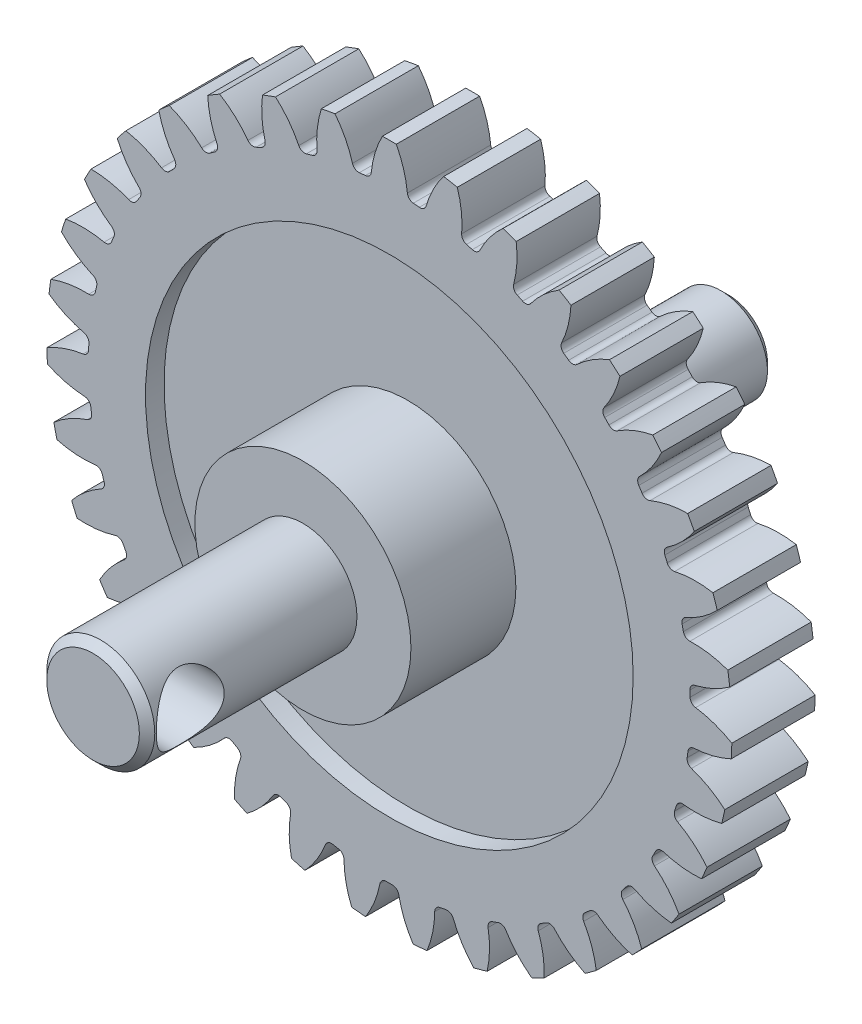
from build123d import *

# Parameters (mm, degrees)
BOSS_EXTRU_1_DEPTH                 = 2.7
CONG_1_R                           = 0.21
R_P_TITION_CIRCULAIRE4_COUNT       = 35
CONG_1_OF_R_P_TITION_CIRCULAIRE4_R = 0.21
ESQUISSE10_R                       = 1.5
ENL_V_MAT_EXTRU_4_DEPTH            = 18.270332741
ESQUISSE11_R                       = 7.9
ENL_V_MAT_EXTRU_5_DEPTH            = 0.6
ENL_V_START                        = -0.7
ESQUISSE12_R                       = 7.9
ENL_V_MAT_EXTRU_6_DEPTH            = 0.7
ESQUISSE13_R                       = 3.5
EXTRUSION1_DEPTH                   = 3.4
ESQUISSE14_R                       = 1.75
EXTRUSION2_DEPTH                   = 10.2
ESQUISSE15_R                       = 2.5
EXTRUSION3_DEPTH                   = 1.1
EXTRUSION4_START                   = 9
ESQUISSE16_R                       = 1.5
EXTRUSION4_DEPTH                   = 9
ESQUISSE20_R                       = 1.1
ENL_V_MAT_EXTRU_7_DEPTH            = 16
CHANFREIN1_SIZE                    = 0.25


with BuildPart() as part:
    # Esquisse3 → Boss.-Extru.1 (new body)
    with BuildSketch(Plane.XY):
        with BuildLine():
            Line((-2.252690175, 9.150396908), (-1.378706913, -0.560352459))
            Line((-1.378706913, -0.560352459), (-0.504723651, 9.150396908))
            ThreePointArc((-0.504723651, 9.150396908), (-0.643080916, 9.161856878), (-0.781587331, 9.171345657))
            ThreePointArc((-0.781587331, 9.171345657), (-0.892351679, 9.874840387), (-1.153571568, 10.537364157))
            ThreePointArc((-1.153571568, 10.537364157), (-1.378706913, 10.539647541), (-1.603842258, 10.537364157))
            ThreePointArc((-1.603842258, 10.537364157), (-1.865062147, 9.874840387), (-1.975826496, 9.171345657))
            ThreePointArc((-1.975826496, 9.171345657), (-2.11433291, 9.161856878), (-2.252690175, 9.150396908))
        make_face()
    boss_extru_1 = extrude(amount=BOSS_EXTRU_1_DEPTH)

    # Cong_1
    cong_1_edges = [part.edges().sort_by_distance(p)[0] for p in [
        (-1.975826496, 9.171345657, 1.35),
        (-0.781587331, 9.171345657, 1.35),
    ]]
    fillet(cong_1_edges, radius=CONG_1_R)

    # R_p_tition circulaire4: Boss.-Extru.1 ×35 about axis
    r_p_tition_circulaire4_axis = Axis((-1.378706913, -0.560352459, 0), (0, 0, 1))
    for i in range(1, R_P_TITION_CIRCULAIRE4_COUNT):
        add(boss_extru_1.rotate(r_p_tition_circulaire4_axis, i * 360 / R_P_TITION_CIRCULAIRE4_COUNT))

    # Cong_1 of R_p_tition circulaire4
    cong_1_of_r_p_tition_circulaire4_edges = [part.edges().sort_by_distance(p)[0] for p in [
        (-3.703892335, 8.908333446, 1.35),
        (-2.528845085, 9.121573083, 1.35),
        (-5.357224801, 8.340989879, 1.35),
        (-4.239136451, 8.760615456, 1.35),
        (-6.882684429, 7.487549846, 1.35),
        (-5.857491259, 8.10007425, 1.35),
        (-8.231241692, 6.37544361, 1.35),
        (-7.331894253, 7.161179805, 1.35),
        (-9.359552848, 5.040415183, 1.35),
        (-8.614956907, 5.974108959, 1.35),
        (-10.231353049, 3.525373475, 1.35),
        (-9.665440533, 4.577015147, 1.35),
        (-10.818621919, 1.879013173, 1.35),
        (-10.449581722, 3.014802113, 1.35),
        (-11.102484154, 0.154249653, 1.35),
        (-10.94217753, 1.337680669, 1.35),
        (-11.073816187, -1.593481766, 1.35),
        (-11.127395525, -0.400445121, 1.35),
        (-10.733539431, -3.30800756, 1.35),
        (-10.999282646, -2.143710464, 1.35),
        (-10.092590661, -4.934221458, 1.35),
        (-10.561956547, -3.836085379, 1.35),
        (-9.171570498, -6.419855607, 1.35),
        (-9.829473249, -5.423175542, 1.35),
        (-8.000081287, -7.717160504, 1.35),
        (-8.825375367, -6.85397057, 1.35),
        (-6.615775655, -8.784439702, 1.35),
        (-7.581935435, -8.082483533, 1.35),
        (-5.063146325, -9.587389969, 1.35),
        (-6.139118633, -9.069229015, 1.35),
        (-3.392096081, -10.100203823, 1.35),
        (-4.543298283, -9.782492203, 1.35),
        (-1.656333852, -10.306399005, 1.35),
        (-2.845765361, -10.199348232, 1.35),
        (0.088351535, -10.199348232, 1.35),
        (-1.101079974, -10.306399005, 1.35),
        (1.785884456, -9.782492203, 1.35),
        (0.634682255, -10.100203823, 1.35),
        (3.381704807, -9.069229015, 1.35),
        (2.305732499, -9.587389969, 1.35),
        (4.824521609, -8.082483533, 1.35),
        (3.858361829, -8.784439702, 1.35),
        (6.067961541, -6.85397057, 1.35),
        (5.24266746, -7.717160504, 1.35),
        (7.072059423, -5.423175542, 1.35),
        (6.414156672, -6.419855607, 1.35),
        (7.804542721, -3.836085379, 1.35),
        (7.335176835, -4.934221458, 1.35),
        (8.241868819, -2.143710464, 1.35),
        (7.976125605, -3.30800756, 1.35),
        (8.369981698, -0.400445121, 1.35),
        (8.316402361, -1.593481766, 1.35),
        (8.184763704, 1.337680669, 1.35),
        (8.345070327, 0.154249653, 1.35),
        (7.692167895, 3.014802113, 1.35),
        (8.061208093, 1.879013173, 1.35),
        (6.908026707, 4.577015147, 1.35),
        (7.473939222, 3.525373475, 1.35),
        (5.857543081, 5.974108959, 1.35),
        (6.602139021, 5.040415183, 1.35),
        (4.574480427, 7.161179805, 1.35),
        (5.473827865, 6.37544361, 1.35),
        (3.100077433, 8.10007425, 1.35),
        (4.125270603, 7.487549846, 1.35),
        (1.481722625, 8.760615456, 1.35),
        (2.599810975, 8.340989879, 1.35),
        (-0.228568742, 9.121573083, 1.35),
        (0.946478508, 8.908333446, 1.35),
    ]]
    fillet(cong_1_of_r_p_tition_circulaire4_edges, radius=CONG_1_OF_R_P_TITION_CIRCULAIRE4_R)

    # Esquisse10 → Enl_v. mat.-Extru.4 (cut, through all)
    with BuildSketch(Plane.XY):
        with Locations(Location((-1.378706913, -0.560352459, 0), (0, 0, 180))):
            Circle(ESQUISSE10_R)
    extrude(amount=ENL_V_MAT_EXTRU_4_DEPTH, mode=Mode.SUBTRACT)

    # Esquisse11 → Enl_v. mat.-Extru.5 (cut)
    with BuildSketch(Plane.XY.offset(2.7)):
        with Locations((-1.378706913, -0.560352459)):
            Circle(ESQUISSE11_R)
    extrude(amount=-ENL_V_MAT_EXTRU_5_DEPTH, mode=Mode.SUBTRACT)

    # Esquisse12 → Enl_v. mat.-Extru.6 (cut)
    with BuildSketch(Plane(origin=(0, 0, 0), x_dir=(-1, 0, 0), z_dir=(0, 0, -1)).offset(ENL_V_START)):
        with Locations(Location((1.378706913, -0.560352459, 0), (0, 0, 180))):
            Circle(ESQUISSE12_R)
    extrude(amount=ENL_V_MAT_EXTRU_6_DEPTH, mode=Mode.SUBTRACT)

    # Esquisse13 → Extrusion1 (add)
    with BuildSketch(Plane.XY.offset(2.1)):
        with Locations((-1.378706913, -0.560352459)):
            Circle(ESQUISSE13_R)
    extrude(amount=EXTRUSION1_DEPTH)

    # Esquisse14 → Extrusion2 (add)
    with BuildSketch(Plane.XY.offset(2.1)):
        with Locations((-1.378706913, -0.560352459)):
            Circle(ESQUISSE14_R)
    extrude(amount=EXTRUSION2_DEPTH)

    # Esquisse15 → Extrusion3 (add)
    with BuildSketch(Plane(origin=(0, 0, 0.7), x_dir=(-1, 0, 0), z_dir=(0, 0, -1))):
        with Locations((1.378706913, -0.560352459)):
            Circle(ESQUISSE15_R)
    extrude(amount=EXTRUSION3_DEPTH)

    # Esquisse16 → Extrusion4 (add)
    with BuildSketch(Plane(origin=(0, 0, 0.7), x_dir=(-1, 0, 0), z_dir=(0, 0, -1)).offset(EXTRUSION4_START)):
        with Locations((1.378706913, -0.560352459)):
            Circle(ESQUISSE16_R)
    extrude(amount=-EXTRUSION4_DEPTH)

    # Esquisse20 → Enl_v. mat.-Extru.7 (cut, symmetric)
    with BuildSketch(Plane(origin=(0, 0, 0), x_dir=(0, 0, -1), z_dir=(1, 0, 0))):
        with Locations(Location((-10.9, -0.560352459, 0), (0, 0, 180.000000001))):
            Circle(ESQUISSE20_R)
    extrude(amount=ENL_V_MAT_EXTRU_7_DEPTH, both=True, mode=Mode.SUBTRACT)

    # Chanfrein1
    chanfrein1_edges = [part.edges().sort_by_distance(p)[0] for p in [
        (-3.128706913, -0.560352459, 12.3),
        (0.121293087, -0.560352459, -8.3),
    ]]
    chamfer(chanfrein1_edges, length=CHANFREIN1_SIZE)


solid = part.part
